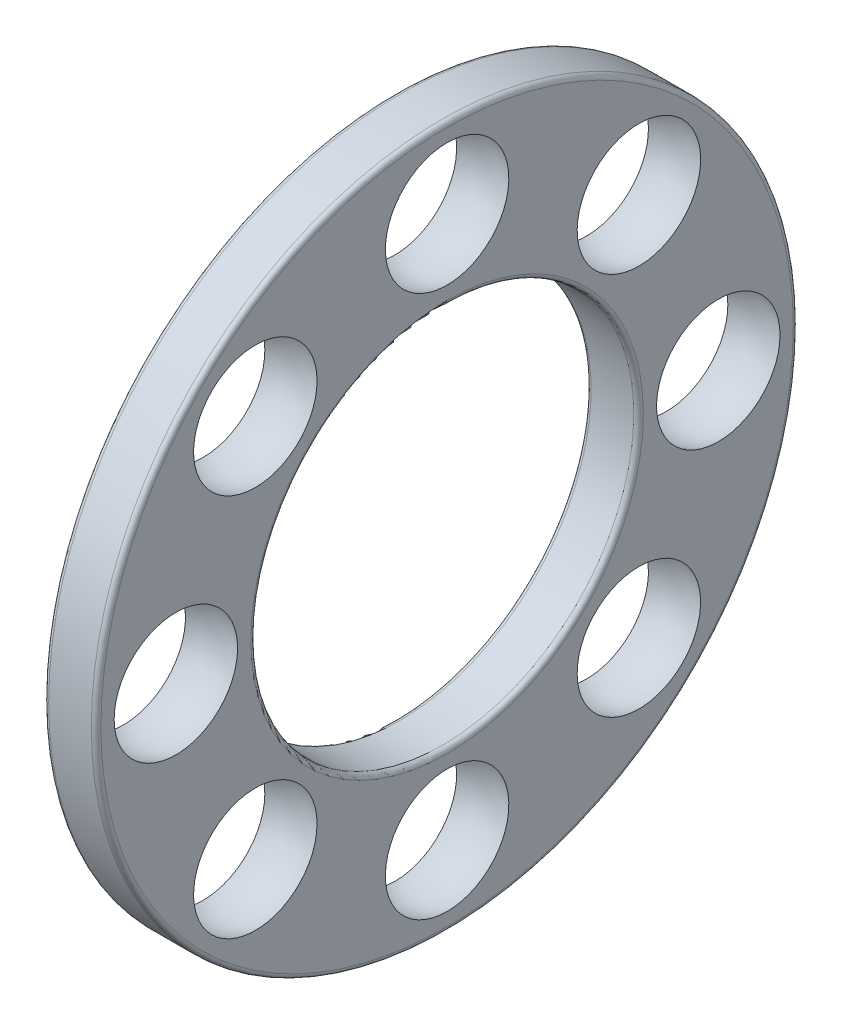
from build123d import *

# Parameters (mm, degrees)
R_P_TITION_CIRCULAIRE1_COUNT = 8


with BuildPart() as part:
    # Esquisse3 → R_volution1 (revolve)
    with BuildSketch(Plane.XY, mode=Mode.PRIVATE) as r_volution1_sk:
        with BuildLine():
            Line((0.667981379, 6), (-0.667981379, 6))
            ThreePointArc((-0.667981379, 6), (-0.774047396, 6.043933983), (-0.817981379, 6.15))
            Line((-0.817981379, 6.15), (-0.817981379, 10.85))
            ThreePointArc((-0.817981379, 10.85), (-0.774047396, 10.956066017), (-0.667981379, 11))
            Line((-0.667981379, 11), (0.667981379, 11))
            ThreePointArc((0.667981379, 11), (0.774047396, 10.956066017), (0.817981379, 10.85))
            Line((0.817981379, 10.85), (0.817981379, 6.15))
            ThreePointArc((0.817981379, 6.15), (0.774047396, 6.043933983), (0.667981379, 6))
        make_face()
    revolve(r_volution1_sk.sketch.rotate(Axis((-6.562481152, 0, 0), (1, 0, 0)), 90), axis=Axis((-6.562481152, 0, 0), (1, 0, 0)))

    # Esquisse4 → Enl_vement de mati_re-R_volution1 (revolve, cut)
    with BuildSketch(Plane.XY):
        with BuildLine():
            Line((-2.1, 8.5), (2.1, 8.5))
            ThreePointArc((2.1, 8.5), (0, 10.6), (-2.1, 8.5))
        make_face()
    enl_vement_de_mati_re_r_volution1 = revolve(axis=Axis((4.680973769, 8.5, 0), (-1, 0, 0)), mode=Mode.SUBTRACT)

    # R_p_tition circulaire1: Enl_vement de mati_re-R_volution1 ×8 about axis
    r_p_tition_circulaire1_axis = Axis((0, 0, 0), (1, 0, 0))
    for i in range(1, R_P_TITION_CIRCULAIRE1_COUNT):
        add(enl_vement_de_mati_re_r_volution1.rotate(r_p_tition_circulaire1_axis, i * 360 / R_P_TITION_CIRCULAIRE1_COUNT), mode=Mode.SUBTRACT)


solid = part.part
